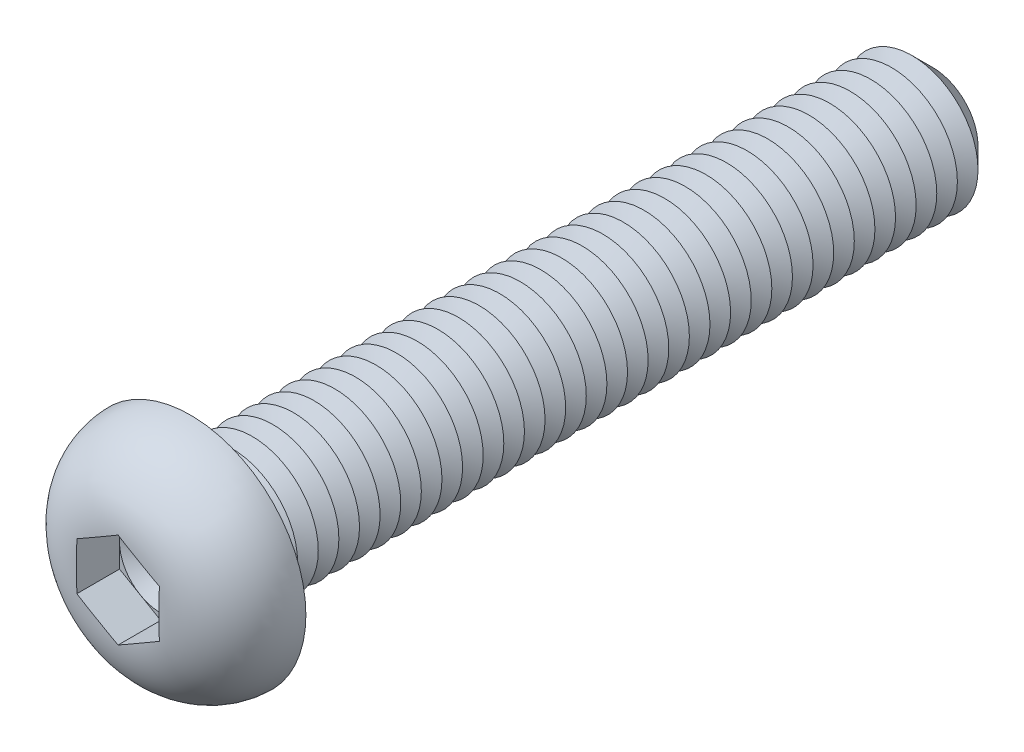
from build123d import *

# Parameters (mm, degrees)
CUT_EXTRUDE1_DEPTH  = 2.6
SKETCH4_R           = 4
BOSS_EXTRUDE1_DEPTH = 45
CHAMFER1_SIZE       = 1.25
LPATTERN1_COUNT     = 34
LPATTERN1_PITCH     = 1.25
FILLET2_R           = 0.5


with BuildPart() as part:
    # Sketch2 → Revolve1 (revolve)
    with BuildSketch(Plane(origin=(0, 0, 0), x_dir=(0, 0, -1), z_dir=(1, 0, 0)), mode=Mode.PRIVATE) as revolve1_sk:
        with BuildLine():
            Line((0, 0), (-4.4, 0))
            Line((-4.4, 0), (-4.4, 2.501111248))
            ThreePointArc((-4.4, 2.501111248), (-3.117141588, 5.647537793), (0, 7))
            Line((0, 7), (0, 0))
        make_face()
    revolve(revolve1_sk.sketch.rotate(Axis((0, 0, 47.934239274), (0, 0, -1)), 90), axis=Axis((0, 0, 47.934239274), (0, 0, -1)))

    # Sketch3 → Cut-Extrude1 (cut)
    with BuildSketch(Plane.XY.offset(4.4)):
        Polygon((0, 2.886751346), (-2.5, 1.443375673), (-2.5, -1.443375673), (0, -2.886751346), (2.5, -1.443375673), (2.5, 1.443375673), align=None)
    extrude(amount=-CUT_EXTRUDE1_DEPTH, mode=Mode.SUBTRACT)

    # Sketch4 → Boss-Extrude1 (add)
    with BuildSketch(Plane(origin=(0, 0, 0), x_dir=(-1, 0, 0), z_dir=(0, 0, -1))):
        with Locations(Location((0, 0, 0), (0, 0, 180))):
            Circle(SKETCH4_R)
    extrude(amount=BOSS_EXTRUDE1_DEPTH)

    # Chamfer1
    chamfer1_edges = [part.edges().sort_by_distance(p)[0] for p in [
        (-4, 0, -45),
    ]]
    chamfer(chamfer1_edges, length=CHAMFER1_SIZE)

    # Sketch5 → Cut-Revolve1 (revolve, cut)
    with BuildSketch(Plane(origin=(0, 0, 0), x_dir=(0, 0, -1), z_dir=(1, 0, 0)), mode=Mode.PRIVATE) as cut_revolve1_sk:
        Polygon((1.25, 4), (2.5, 4), (1.875, 2.917468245), align=None)
    cut_revolve1 = revolve(cut_revolve1_sk.sketch.rotate(Axis((0, 0, 47.934239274), (0, 0, -1)), 90), axis=Axis((0, 0, 47.934239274), (0, 0, -1)), mode=Mode.SUBTRACT)

    # LPattern1: Cut-Revolve1 ×34
    with Locations(*[(0, 0, -i * LPATTERN1_PITCH) for i in range(1, LPATTERN1_COUNT)]):
        add(cut_revolve1, mode=Mode.SUBTRACT)

    # Fillet2
    fillet2_edges = [part.edges().sort_by_distance(p)[0] for p in [
        (-4, 0, 0),
    ]]
    fillet(fillet2_edges, radius=FILLET2_R)

    # Cut-Extrude2 cone 1 section (on through the dimple's axis) → Cut-Extrude2 (revolve, cut)
    with BuildSketch(Plane(origin=(0, 0, 1.8), x_dir=(0, -1, 0), z_dir=(1, 0, 0))):
        Polygon((0, 0), (2.5, 0), (0, 1.443375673), align=None)
    revolve(axis=Axis((0, 0, 1.8), (0, 0, -1)), mode=Mode.SUBTRACT)


solid = part.part
